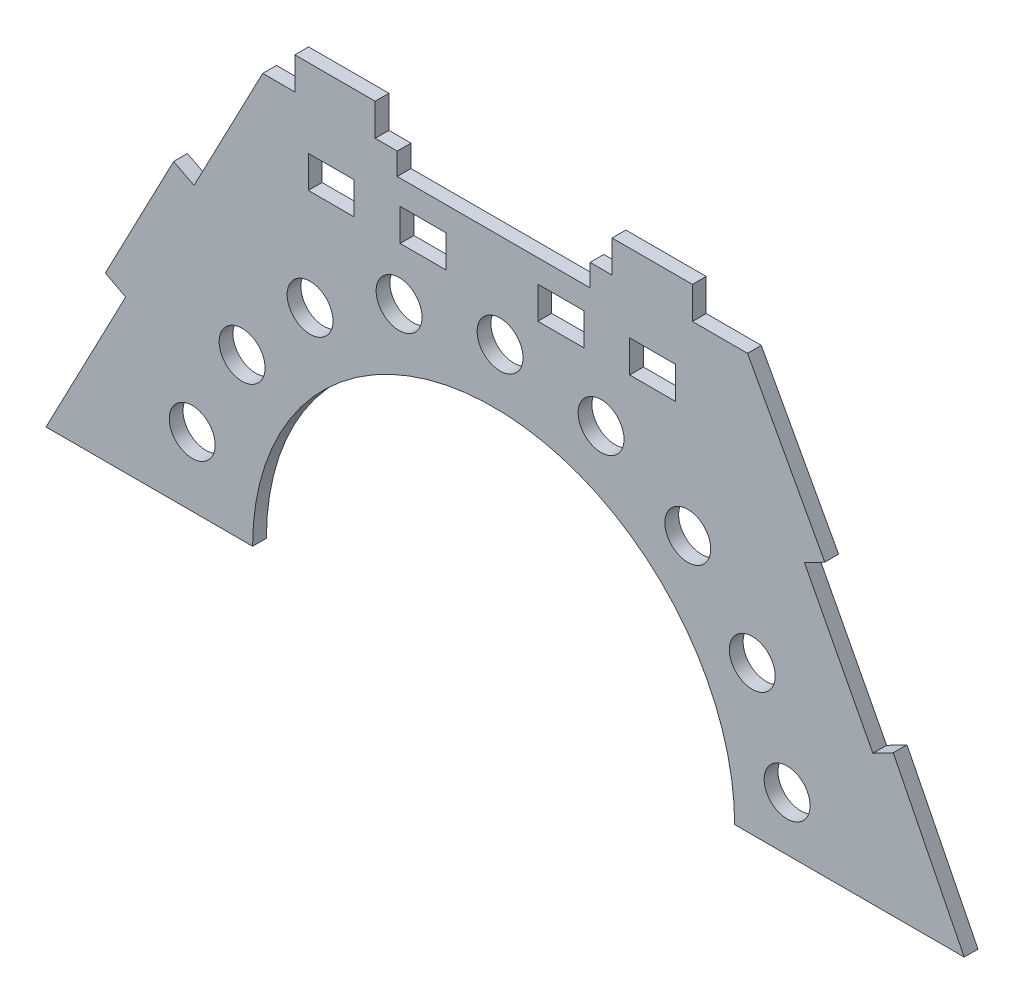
from build123d import *

# Parameters (mm, degrees)
SKETCH2_R           = 5
SKETCH2_W           = 10
SKETCH2_H           = 7
BOSS_EXTRUDE3_DEPTH = 3


with BuildPart() as part:
    # Sketch2 → Boss-Extrude3 (new body)
    with BuildSketch(Plane.XY):
        with BuildLine():
            Line((-97.5, 0), (-52.5, 0))
            ThreePointArc((-52.5, 0), (0, 52.5), (52.5, 0))
            Line((52.5, 0), (102.5, 0))
            Line((102.5, 0), (87.034163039, 30.816183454))
            Line((87.034163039, 30.816183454), (82.602990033, 28.5))
            Line((82.602990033, 28.5), (67.705980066, 57))
            Line((67.705980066, 57), (72.137153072, 59.316183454))
            Line((72.137153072, 59.316183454), (55.3, 90.3))
            Line((55.3, 90.3), (43.3, 90.3))
            Line((43.3, 90.3), (43.3, 97.3))
            Line((43.3, 97.3), (25.8, 97.3))
            Line((25.8, 97.3), (25.8, 90.3))
            Line((25.8, 90.3), (21, 90.3))
            Line((21, 90.3), (21, 85.5))
            Line((21, 85.5), (-21, 85.5))
            Line((-21, 85.5), (-21, 90.3))
            Line((-21, 90.3), (-25.8, 90.3))
            Line((-25.8, 90.3), (-25.8, 97.3))
            Line((-25.8, 97.3), (-43.3, 97.3))
            Line((-43.3, 97.3), (-43.3, 90.3))
            Line((-43.3, 90.3), (-50.3, 90.3))
            Line((-50.3, 90.3), (-65.257739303, 61.683816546))
            Line((-65.257739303, 61.683816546), (-69.688912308, 64))
            Line((-69.688912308, 64), (-84.585922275, 35.5))
            Line((-84.585922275, 35.5), (-80.154749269, 33.183816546))
            Line((-80.154749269, 33.183816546), (-97.5, 0))
        make_face()
        with Locations((-65.658571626, 15)):
            Circle(SKETCH2_R, mode=Mode.SUBTRACT)
        with Locations((-54.787030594, 34.976867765)):
            Circle(SKETCH2_R, mode=Mode.SUBTRACT)
        with Locations((63.924546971, 11.775070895)):
            Circle(SKETCH2_R, mode=Mode.SUBTRACT)
        with Locations((56.335145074, 32.424549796)):
            Circle(SKETCH2_R, mode=Mode.SUBTRACT)
        with Locations((-39.981359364, 51.249301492)):
            Circle(SKETCH2_R, mode=Mode.SUBTRACT)
        with Locations((-20.595575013, 61.650809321)):
            Circle(SKETCH2_R, mode=Mode.SUBTRACT)
        with Locations((1.404424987, 65)):
            Circle(SKETCH2_R, mode=Mode.SUBTRACT)
        with Locations((-35.364333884, 76.687251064)):
            Rectangle(SKETCH2_W, SKETCH2_H, mode=Mode.SUBTRACT)
        with Locations((-15.364333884, 76.687251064)):
            Rectangle(SKETCH2_W, SKETCH2_H, mode=Mode.SUBTRACT)
        with Locations((23.404424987, 60.640192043)):
            Circle(SKETCH2_R, mode=Mode.SUBTRACT)
        with Locations((42.292202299, 49.359595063)):
            Circle(SKETCH2_R, mode=Mode.SUBTRACT)
        with Locations((14.635666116, 77.006396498)):
            Rectangle(SKETCH2_W, SKETCH2_H, mode=Mode.SUBTRACT)
        with Locations((34.635666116, 76.878738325)):
            Rectangle(SKETCH2_W, SKETCH2_H, mode=Mode.SUBTRACT)
    extrude(amount=BOSS_EXTRUDE3_DEPTH)


solid = part.part
